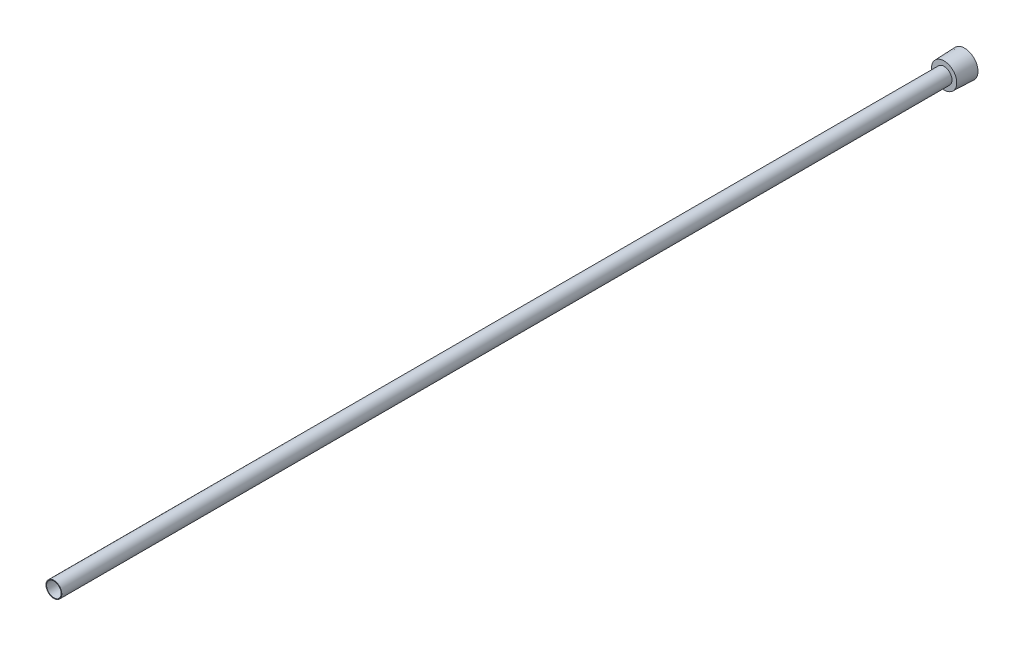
ISO-10303-21;
HEADER;
FILE_DESCRIPTION(('STEP AP214'),'2;1');
FILE_NAME('part.step','',(''),(''),'','','');
FILE_SCHEMA(('AUTOMOTIVE_DESIGN { 1 0 10303 214 1 1 1 1 }'));
ENDSEC;
DATA;
#1=APPLICATION_CONTEXT('core data for automotive mechanical design processes');
#2=APPLICATION_PROTOCOL_DEFINITION('international standard','automotive_design',2000,#1);
#3=PRODUCT_CONTEXT('',#1,'mechanical');
#4=PRODUCT('Part','Part','',(#3));
#5=PRODUCT_RELATED_PRODUCT_CATEGORY('part','',(#4));
#6=PRODUCT_DEFINITION_FORMATION('','',#4);
#7=PRODUCT_DEFINITION_CONTEXT('part definition',#1,'design');
#8=PRODUCT_DEFINITION('design','',#6,#7);
#9=PRODUCT_DEFINITION_SHAPE('','',#8);
#10=(LENGTH_UNIT() NAMED_UNIT(*) SI_UNIT(.MILLI.,.METRE.));
#11=(NAMED_UNIT(*) PLANE_ANGLE_UNIT() SI_UNIT($,.RADIAN.));
#12=(NAMED_UNIT(*) SI_UNIT($,.STERADIAN.) SOLID_ANGLE_UNIT());
#13=UNCERTAINTY_MEASURE_WITH_UNIT(LENGTH_MEASURE(1.E-05),#10,'distance_accuracy_value','');
#14=(GEOMETRIC_REPRESENTATION_CONTEXT(3) GLOBAL_UNCERTAINTY_ASSIGNED_CONTEXT((#13)) GLOBAL_UNIT_ASSIGNED_CONTEXT((#10,
#11,#12)) REPRESENTATION_CONTEXT('',''));
#15=CARTESIAN_POINT('',(0.,0.,0.));
#16=DIRECTION('',(0.,0.,1.));
#17=DIRECTION('',(1.,0.,0.));
#18=AXIS2_PLACEMENT_3D('',#15,#16,#17);
#19=CARTESIAN_POINT('',(0.,0.,0.));
#20=DIRECTION('',(0.,0.,1.));
#21=DIRECTION('',(1.,0.,0.));
#22=AXIS2_PLACEMENT_3D('',#19,#20,#21);
#23=CYLINDRICAL_SURFACE('',#22,3.65125);
#24=CARTESIAN_POINT('',(0.,0.,457.2));
#25=DIRECTION('',(0.,0.,1.));
#26=DIRECTION('',(1.,0.,0.));
#27=AXIS2_PLACEMENT_3D('',#24,#25,#26);
#28=CIRCLE('',#27,3.65125);
#29=CARTESIAN_POINT('',(3.65125,0.,457.2));
#30=VERTEX_POINT('',#29);
#31=EDGE_CURVE('E142',#30,#30,#28,.T.);
#32=ORIENTED_EDGE('',*,*,#31,.T.);
#33=EDGE_LOOP('',(#32));
#34=FACE_BOUND('',#33,.T.);
#35=CARTESIAN_POINT('',(0.,0.,6.35));
#36=DIRECTION('',(0.,0.,-1.));
#37=DIRECTION('',(-1.,0.,0.));
#38=AXIS2_PLACEMENT_3D('',#35,#36,#37);
#39=CIRCLE('',#38,3.65125);
#40=CARTESIAN_POINT('',(-3.65125,0.,6.35));
#41=VERTEX_POINT('',#40);
#42=EDGE_CURVE('E37',#41,#41,#39,.F.);
#43=ORIENTED_EDGE('',*,*,#42,.F.);
#44=EDGE_LOOP('',(#43));
#45=FACE_BOUND('',#44,.T.);
#46=ADVANCED_FACE('F33',(#34,#45),#23,.F.);
#47=CARTESIAN_POINT('',(0.,0.,0.));
#48=DIRECTION('',(0.,0.,-1.));
#49=DIRECTION('',(-1.,0.,0.));
#50=AXIS2_PLACEMENT_3D('',#47,#48,#49);
#51=CONICAL_SURFACE('',#50,6.7183,0.0364599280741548);
#52=CARTESIAN_POINT('',(0.,0.,10.3124));
#53=DIRECTION('',(0.,0.,1.));
#54=DIRECTION('',(1.,0.,0.));
#55=AXIS2_PLACEMENT_3D('',#52,#53,#54);
#56=CIRCLE('',#55,6.34214394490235);
#57=CARTESIAN_POINT('',(6.34214394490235,0.,10.3124));
#58=VERTEX_POINT('',#57);
#59=EDGE_CURVE('E11',#58,#58,#56,.T.);
#60=ORIENTED_EDGE('',*,*,#59,.F.);
#61=EDGE_LOOP('',(#60));
#62=FACE_BOUND('',#61,.T.);
#63=CARTESIAN_POINT('',(0.,0.,0.));
#64=DIRECTION('',(0.,0.,1.));
#65=DIRECTION('',(1.,0.,0.));
#66=AXIS2_PLACEMENT_3D('',#63,#64,#65);
#67=CIRCLE('',#66,6.7183);
#68=CARTESIAN_POINT('',(6.7183,0.,0.));
#69=VERTEX_POINT('',#68);
#70=EDGE_CURVE('E145',#69,#69,#67,.T.);
#71=ORIENTED_EDGE('',*,*,#70,.T.);
#72=EDGE_LOOP('',(#71));
#73=FACE_BOUND('',#72,.T.);
#74=ADVANCED_FACE('F35',(#62,#73),#51,.T.);
#75=CARTESIAN_POINT('',(0.,6.34214394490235,10.3124));
#76=DIRECTION('',(0.,0.,-1.));
#77=DIRECTION('',(-1.,0.,0.));
#78=AXIS2_PLACEMENT_3D('',#75,#76,#77);
#79=PLANE('',#78);
#80=CARTESIAN_POINT('',(0.,0.,10.3124));
#81=DIRECTION('',(0.,0.,1.));
#82=DIRECTION('',(1.,0.,0.));
#83=AXIS2_PLACEMENT_3D('',#80,#81,#82);
#84=CIRCLE('',#83,3.96875);
#85=CARTESIAN_POINT('',(3.96875,0.,10.3124));
#86=VERTEX_POINT('',#85);
#87=EDGE_CURVE('E42',#86,#86,#84,.T.);
#88=ORIENTED_EDGE('',*,*,#87,.F.);
#89=EDGE_LOOP('',(#88));
#90=FACE_BOUND('',#89,.T.);
#91=ORIENTED_EDGE('',*,*,#59,.T.);
#92=EDGE_LOOP('',(#91));
#93=FACE_BOUND('',#92,.T.);
#94=ADVANCED_FACE('F156',(#90,#93),#79,.F.);
#95=CARTESIAN_POINT('',(0.,0.,331.124179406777));
#96=DIRECTION('',(0.,0.,1.));
#97=DIRECTION('',(1.,0.,0.));
#98=AXIS2_PLACEMENT_3D('',#95,#96,#97);
#99=CYLINDRICAL_SURFACE('',#98,3.96874999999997);
#100=CARTESIAN_POINT('',(0.,0.,457.2));
#101=DIRECTION('',(0.,0.,1.));
#102=DIRECTION('',(1.,0.,0.));
#103=AXIS2_PLACEMENT_3D('',#100,#101,#102);
#104=CIRCLE('',#103,3.96874999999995);
#105=CARTESIAN_POINT('',(3.96874999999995,0.,457.2));
#106=VERTEX_POINT('',#105);
#107=EDGE_CURVE('E148',#106,#106,#104,.T.);
#108=ORIENTED_EDGE('',*,*,#107,.F.);
#109=EDGE_LOOP('',(#108));
#110=FACE_BOUND('',#109,.T.);
#111=ORIENTED_EDGE('',*,*,#87,.T.);
#112=EDGE_LOOP('',(#111));
#113=FACE_BOUND('',#112,.T.);
#114=ADVANCED_FACE('F154',(#110,#113),#99,.T.);
#115=CARTESIAN_POINT('',(0.,3.96874999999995,457.2));
#116=DIRECTION('',(0.,0.,-1.));
#117=DIRECTION('',(-1.,0.,0.));
#118=AXIS2_PLACEMENT_3D('',#115,#116,#117);
#119=PLANE('',#118);
#120=ORIENTED_EDGE('',*,*,#31,.F.);
#121=EDGE_LOOP('',(#120));
#122=FACE_BOUND('',#121,.T.);
#123=ORIENTED_EDGE('',*,*,#107,.T.);
#124=EDGE_LOOP('',(#123));
#125=FACE_BOUND('',#124,.T.);
#126=ADVANCED_FACE('F167',(#122,#125),#119,.F.);
#127=CARTESIAN_POINT('',(0.,0.,0.));
#128=DIRECTION('',(0.,0.,1.));
#129=DIRECTION('',(1.,0.,0.));
#130=AXIS2_PLACEMENT_3D('',#127,#128,#129);
#131=PLANE('',#130);
#132=DIRECTION('',(-0.866025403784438,-0.5,0.));
#133=VECTOR('',#132,1.);
#134=CARTESIAN_POINT('',(4.7625,-2.74963065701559,0.));
#135=LINE('',#134,#133);
#136=CARTESIAN_POINT('',(4.7625,-2.74963065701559,0.));
#137=VERTEX_POINT('',#136);
#138=CARTESIAN_POINT('',(0.,-5.49926131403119,0.));
#139=VERTEX_POINT('',#138);
#140=EDGE_CURVE('E124',#137,#139,#135,.T.);
#141=ORIENTED_EDGE('',*,*,#140,.F.);
#142=DIRECTION('',(0.,-1.,0.));
#143=VECTOR('',#142,1.);
#144=CARTESIAN_POINT('',(4.7625,2.74963065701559,0.));
#145=LINE('',#144,#143);
#146=CARTESIAN_POINT('',(4.7625,2.74963065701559,0.));
#147=VERTEX_POINT('',#146);
#148=EDGE_CURVE('E49',#147,#137,#145,.T.);
#149=ORIENTED_EDGE('',*,*,#148,.F.);
#150=DIRECTION('',(0.866025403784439,-0.5,0.));
#151=VECTOR('',#150,1.);
#152=CARTESIAN_POINT('',(0.,5.49926131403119,0.));
#153=LINE('',#152,#151);
#154=CARTESIAN_POINT('',(0.,5.49926131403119,0.));
#155=VERTEX_POINT('',#154);
#156=EDGE_CURVE('E133',#155,#147,#153,.T.);
#157=ORIENTED_EDGE('',*,*,#156,.F.);
#158=DIRECTION('',(0.866025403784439,0.5,0.));
#159=VECTOR('',#158,1.);
#160=CARTESIAN_POINT('',(-4.7625,2.7496306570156,0.));
#161=LINE('',#160,#159);
#162=CARTESIAN_POINT('',(-4.7625,2.7496306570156,0.));
#163=VERTEX_POINT('',#162);
#164=EDGE_CURVE('E131',#163,#155,#161,.T.);
#165=ORIENTED_EDGE('',*,*,#164,.F.);
#166=DIRECTION('',(0.,1.,0.));
#167=VECTOR('',#166,1.);
#168=CARTESIAN_POINT('',(-4.7625,-2.74963065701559,0.));
#169=LINE('',#168,#167);
#170=CARTESIAN_POINT('',(-4.7625,-2.74963065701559,0.));
#171=VERTEX_POINT('',#170);
#172=EDGE_CURVE('E97',#171,#163,#169,.T.);
#173=ORIENTED_EDGE('',*,*,#172,.F.);
#174=DIRECTION('',(-0.866025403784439,0.5,0.));
#175=VECTOR('',#174,1.);
#176=CARTESIAN_POINT('',(0.,-5.49926131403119,0.));
#177=LINE('',#176,#175);
#178=EDGE_CURVE('E127',#139,#171,#177,.T.);
#179=ORIENTED_EDGE('',*,*,#178,.F.);
#180=EDGE_LOOP('',(#141,#149,#157,#165,#173,#179));
#181=FACE_BOUND('',#180,.T.);
#182=ORIENTED_EDGE('',*,*,#70,.F.);
#183=EDGE_LOOP('',(#182));
#184=FACE_BOUND('',#183,.T.);
#185=ADVANCED_FACE('F165',(#181,#184),#131,.F.);
#186=CARTESIAN_POINT('',(4.7625,-2.74963065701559,6.35));
#187=DIRECTION('',(0.,0.,-1.));
#188=DIRECTION('',(-1.,0.,0.));
#189=AXIS2_PLACEMENT_3D('',#186,#187,#188);
#190=PLANE('',#189);
#191=DIRECTION('',(0.,-1.,0.));
#192=VECTOR('',#191,1.);
#193=CARTESIAN_POINT('',(4.7625,2.74963065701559,6.35));
#194=LINE('',#193,#192);
#195=CARTESIAN_POINT('',(4.7625,2.74963065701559,6.35));
#196=VERTEX_POINT('',#195);
#197=CARTESIAN_POINT('',(4.7625,-2.74963065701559,6.35));
#198=VERTEX_POINT('',#197);
#199=EDGE_CURVE('E135',#196,#198,#194,.T.);
#200=ORIENTED_EDGE('',*,*,#199,.T.);
#201=DIRECTION('',(-0.866025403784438,-0.5,0.));
#202=VECTOR('',#201,1.);
#203=CARTESIAN_POINT('',(4.7625,-2.74963065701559,6.35));
#204=LINE('',#203,#202);
#205=CARTESIAN_POINT('',(0.,-5.49926131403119,6.35));
#206=VERTEX_POINT('',#205);
#207=EDGE_CURVE('E118',#198,#206,#204,.T.);
#208=ORIENTED_EDGE('',*,*,#207,.T.);
#209=DIRECTION('',(-0.866025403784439,0.5,0.));
#210=VECTOR('',#209,1.);
#211=CARTESIAN_POINT('',(0.,-5.49926131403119,6.35));
#212=LINE('',#211,#210);
#213=CARTESIAN_POINT('',(-4.7625,-2.74963065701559,6.35));
#214=VERTEX_POINT('',#213);
#215=EDGE_CURVE('E116',#206,#214,#212,.T.);
#216=ORIENTED_EDGE('',*,*,#215,.T.);
#217=DIRECTION('',(0.,1.,0.));
#218=VECTOR('',#217,1.);
#219=CARTESIAN_POINT('',(-4.7625,-2.74963065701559,6.35));
#220=LINE('',#219,#218);
#221=CARTESIAN_POINT('',(-4.7625,2.7496306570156,6.35));
#222=VERTEX_POINT('',#221);
#223=EDGE_CURVE('E94',#214,#222,#220,.T.);
#224=ORIENTED_EDGE('',*,*,#223,.T.);
#225=DIRECTION('',(0.866025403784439,0.5,0.));
#226=VECTOR('',#225,1.);
#227=CARTESIAN_POINT('',(-4.7625,2.7496306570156,6.35));
#228=LINE('',#227,#226);
#229=CARTESIAN_POINT('',(0.,5.49926131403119,6.35));
#230=VERTEX_POINT('',#229);
#231=EDGE_CURVE('E105',#222,#230,#228,.T.);
#232=ORIENTED_EDGE('',*,*,#231,.T.);
#233=DIRECTION('',(0.866025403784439,-0.5,0.));
#234=VECTOR('',#233,1.);
#235=CARTESIAN_POINT('',(0.,5.49926131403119,6.35));
#236=LINE('',#235,#234);
#237=EDGE_CURVE('E109',#230,#196,#236,.T.);
#238=ORIENTED_EDGE('',*,*,#237,.T.);
#239=EDGE_LOOP('',(#200,#208,#216,#224,#232,#238));
#240=FACE_BOUND('',#239,.T.);
#241=ORIENTED_EDGE('',*,*,#42,.T.);
#242=EDGE_LOOP('',(#241));
#243=FACE_BOUND('',#242,.T.);
#244=ADVANCED_FACE('F112',(#240,#243),#190,.T.);
#245=CARTESIAN_POINT('',(4.7625,2.74963065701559,6.35));
#246=DIRECTION('',(1.,0.,0.));
#247=DIRECTION('',(0.,1.,0.));
#248=AXIS2_PLACEMENT_3D('',#245,#246,#247);
#249=PLANE('',#248);
#250=ORIENTED_EDGE('',*,*,#148,.T.);
#251=DIRECTION('',(0.,0.,-1.));
#252=VECTOR('',#251,1.);
#253=CARTESIAN_POINT('',(4.7625,-2.74963065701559,6.35));
#254=LINE('',#253,#252);
#255=EDGE_CURVE('E79',#198,#137,#254,.T.);
#256=ORIENTED_EDGE('',*,*,#255,.F.);
#257=ORIENTED_EDGE('',*,*,#199,.F.);
#258=DIRECTION('',(0.,0.,-1.));
#259=VECTOR('',#258,1.);
#260=CARTESIAN_POINT('',(4.7625,2.74963065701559,6.35));
#261=LINE('',#260,#259);
#262=EDGE_CURVE('E57',#196,#147,#261,.T.);
#263=ORIENTED_EDGE('',*,*,#262,.T.);
#264=EDGE_LOOP('',(#250,#256,#257,#263));
#265=FACE_BOUND('',#264,.T.);
#266=ADVANCED_FACE('F174',(#265),#249,.F.);
#267=CARTESIAN_POINT('',(0.,5.49926131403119,6.35));
#268=DIRECTION('',(0.5,0.866025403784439,0.));
#269=DIRECTION('',(-0.866025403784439,0.5,0.));
#270=AXIS2_PLACEMENT_3D('',#267,#268,#269);
#271=PLANE('',#270);
#272=ORIENTED_EDGE('',*,*,#156,.T.);
#273=ORIENTED_EDGE('',*,*,#262,.F.);
#274=ORIENTED_EDGE('',*,*,#237,.F.);
#275=DIRECTION('',(0.,0.,-1.));
#276=VECTOR('',#275,1.);
#277=CARTESIAN_POINT('',(0.,5.49926131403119,6.35));
#278=LINE('',#277,#276);
#279=EDGE_CURVE('E101',#230,#155,#278,.T.);
#280=ORIENTED_EDGE('',*,*,#279,.T.);
#281=EDGE_LOOP('',(#272,#273,#274,#280));
#282=FACE_BOUND('',#281,.T.);
#283=ADVANCED_FACE('F188',(#282),#271,.F.);
#284=CARTESIAN_POINT('',(-4.7625,2.7496306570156,6.35));
#285=DIRECTION('',(-0.5,0.866025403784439,0.));
#286=DIRECTION('',(-0.866025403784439,-0.5,0.));
#287=AXIS2_PLACEMENT_3D('',#284,#285,#286);
#288=PLANE('',#287);
#289=ORIENTED_EDGE('',*,*,#164,.T.);
#290=ORIENTED_EDGE('',*,*,#279,.F.);
#291=ORIENTED_EDGE('',*,*,#231,.F.);
#292=DIRECTION('',(0.,0.,-1.));
#293=VECTOR('',#292,1.);
#294=CARTESIAN_POINT('',(-4.7625,2.7496306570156,6.35));
#295=LINE('',#294,#293);
#296=EDGE_CURVE('E90',#222,#163,#295,.T.);
#297=ORIENTED_EDGE('',*,*,#296,.T.);
#298=EDGE_LOOP('',(#289,#290,#291,#297));
#299=FACE_BOUND('',#298,.T.);
#300=ADVANCED_FACE('F106',(#299),#288,.F.);
#301=CARTESIAN_POINT('',(-4.7625,-2.74963065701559,6.35));
#302=DIRECTION('',(-1.,0.,0.));
#303=DIRECTION('',(0.,0.,1.));
#304=AXIS2_PLACEMENT_3D('',#301,#302,#303);
#305=PLANE('',#304);
#306=ORIENTED_EDGE('',*,*,#172,.T.);
#307=ORIENTED_EDGE('',*,*,#296,.F.);
#308=ORIENTED_EDGE('',*,*,#223,.F.);
#309=DIRECTION('',(0.,0.,-1.));
#310=VECTOR('',#309,1.);
#311=CARTESIAN_POINT('',(-4.7625,-2.74963065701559,6.35));
#312=LINE('',#311,#310);
#313=EDGE_CURVE('E102',#214,#171,#312,.T.);
#314=ORIENTED_EDGE('',*,*,#313,.T.);
#315=EDGE_LOOP('',(#306,#307,#308,#314));
#316=FACE_BOUND('',#315,.T.);
#317=ADVANCED_FACE('F92',(#316),#305,.F.);
#318=CARTESIAN_POINT('',(0.,-5.49926131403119,6.35));
#319=DIRECTION('',(-0.5,-0.866025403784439,0.));
#320=DIRECTION('',(0.866025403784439,-0.5,0.));
#321=AXIS2_PLACEMENT_3D('',#318,#319,#320);
#322=PLANE('',#321);
#323=ORIENTED_EDGE('',*,*,#178,.T.);
#324=ORIENTED_EDGE('',*,*,#313,.F.);
#325=ORIENTED_EDGE('',*,*,#215,.F.);
#326=DIRECTION('',(0.,0.,-1.));
#327=VECTOR('',#326,1.);
#328=CARTESIAN_POINT('',(0.,-5.49926131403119,6.35));
#329=LINE('',#328,#327);
#330=EDGE_CURVE('E139',#206,#139,#329,.T.);
#331=ORIENTED_EDGE('',*,*,#330,.T.);
#332=EDGE_LOOP('',(#323,#324,#325,#331));
#333=FACE_BOUND('',#332,.T.);
#334=ADVANCED_FACE('F192',(#333),#322,.F.);
#335=CARTESIAN_POINT('',(4.7625,-2.74963065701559,6.35));
#336=DIRECTION('',(0.5,-0.866025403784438,0.));
#337=DIRECTION('',(0.866025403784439,0.5,0.));
#338=AXIS2_PLACEMENT_3D('',#335,#336,#337);
#339=PLANE('',#338);
#340=ORIENTED_EDGE('',*,*,#140,.T.);
#341=ORIENTED_EDGE('',*,*,#330,.F.);
#342=ORIENTED_EDGE('',*,*,#207,.F.);
#343=ORIENTED_EDGE('',*,*,#255,.T.);
#344=EDGE_LOOP('',(#340,#341,#342,#343));
#345=FACE_BOUND('',#344,.T.);
#346=ADVANCED_FACE('F189',(#345),#339,.F.);
#347=CLOSED_SHELL('',(#46,#74,#94,#114,#126,#185,#244,#266,#283,#300,#317,#334,#346));
#348=MANIFOLD_SOLID_BREP('B2',#347);
#349=ADVANCED_BREP_SHAPE_REPRESENTATION('',(#18,#348),#14);
#350=SHAPE_DEFINITION_REPRESENTATION(#9,#349);
ENDSEC;
END-ISO-10303-21;
